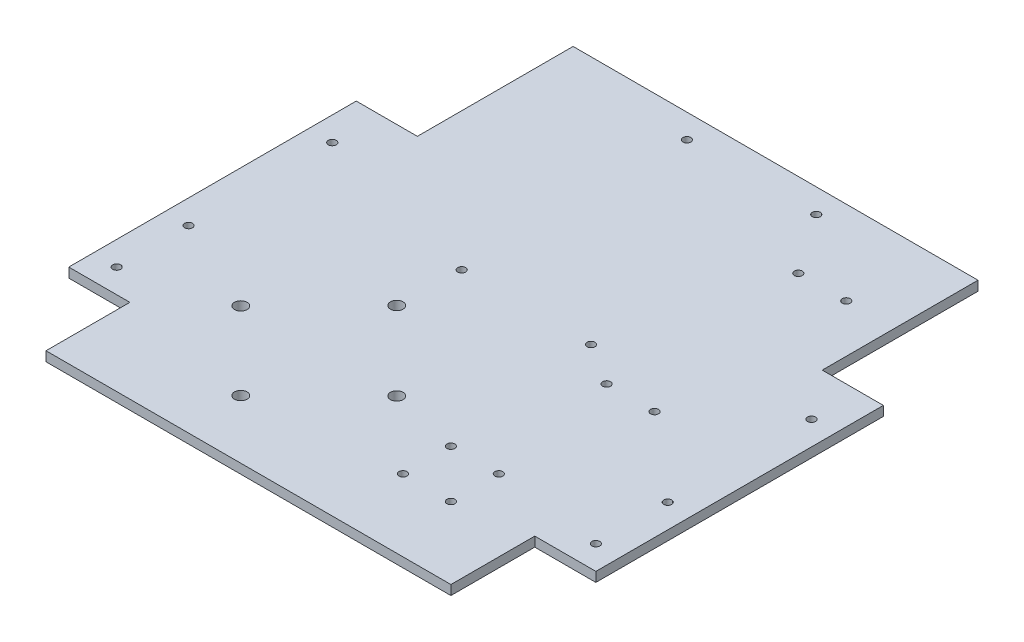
ISO-10303-21;
HEADER;
FILE_DESCRIPTION(('STEP AP214'),'2;1');
FILE_NAME('part.step','',(''),(''),'','','');
FILE_SCHEMA(('AUTOMOTIVE_DESIGN { 1 0 10303 214 1 1 1 1 }'));
ENDSEC;
DATA;
#1=APPLICATION_CONTEXT('core data for automotive mechanical design processes');
#2=APPLICATION_PROTOCOL_DEFINITION('international standard','automotive_design',2000,#1);
#3=PRODUCT_CONTEXT('',#1,'mechanical');
#4=PRODUCT('Part','Part','',(#3));
#5=PRODUCT_RELATED_PRODUCT_CATEGORY('part','',(#4));
#6=PRODUCT_DEFINITION_FORMATION('','',#4);
#7=PRODUCT_DEFINITION_CONTEXT('part definition',#1,'design');
#8=PRODUCT_DEFINITION('design','',#6,#7);
#9=PRODUCT_DEFINITION_SHAPE('','',#8);
#10=(LENGTH_UNIT() NAMED_UNIT(*) SI_UNIT(.MILLI.,.METRE.));
#11=(NAMED_UNIT(*) PLANE_ANGLE_UNIT() SI_UNIT($,.RADIAN.));
#12=(NAMED_UNIT(*) SI_UNIT($,.STERADIAN.) SOLID_ANGLE_UNIT());
#13=UNCERTAINTY_MEASURE_WITH_UNIT(LENGTH_MEASURE(1.E-05),#10,'distance_accuracy_value','');
#14=(GEOMETRIC_REPRESENTATION_CONTEXT(3) GLOBAL_UNCERTAINTY_ASSIGNED_CONTEXT((#13)) GLOBAL_UNIT_ASSIGNED_CONTEXT((#10,
#11,#12)) REPRESENTATION_CONTEXT('',''));
#15=CARTESIAN_POINT('',(0.,0.,0.));
#16=DIRECTION('',(0.,0.,1.));
#17=DIRECTION('',(1.,0.,0.));
#18=AXIS2_PLACEMENT_3D('',#15,#16,#17);
#19=CARTESIAN_POINT('',(84.5,-16.,0.));
#20=DIRECTION('',(-1.,0.,0.));
#21=DIRECTION('',(0.,1.,0.));
#22=AXIS2_PLACEMENT_3D('',#19,#20,#21);
#23=PLANE('',#22);
#24=DIRECTION('',(0.,0.,-1.));
#25=VECTOR('',#24,1.);
#26=CARTESIAN_POINT('',(84.5,0.,0.));
#27=LINE('',#26,#25);
#28=CARTESIAN_POINT('',(84.5,0.,-45.));
#29=VERTEX_POINT('',#28);
#30=CARTESIAN_POINT('',(84.5,0.,-110.));
#31=VERTEX_POINT('',#30);
#32=EDGE_CURVE('E170',#29,#31,#27,.T.);
#33=ORIENTED_EDGE('',*,*,#32,.T.);
#34=DIRECTION('',(0.,-1.,0.));
#35=VECTOR('',#34,1.);
#36=CARTESIAN_POINT('',(84.5,4.,-110.));
#37=LINE('',#36,#35);
#38=CARTESIAN_POINT('',(84.5,4.,-110.));
#39=VERTEX_POINT('',#38);
#40=EDGE_CURVE('E185',#39,#31,#37,.T.);
#41=ORIENTED_EDGE('',*,*,#40,.F.);
#42=DIRECTION('',(0.,0.,1.));
#43=VECTOR('',#42,1.);
#44=CARTESIAN_POINT('',(84.5,4.,0.));
#45=LINE('',#44,#43);
#46=CARTESIAN_POINT('',(84.5,4.,-45.));
#47=VERTEX_POINT('',#46);
#48=EDGE_CURVE('E235',#39,#47,#45,.T.);
#49=ORIENTED_EDGE('',*,*,#48,.T.);
#50=DIRECTION('',(0.,1.,0.));
#51=VECTOR('',#50,1.);
#52=CARTESIAN_POINT('',(84.5,-16.,-45.));
#53=LINE('',#52,#51);
#54=EDGE_CURVE('E11',#29,#47,#53,.T.);
#55=ORIENTED_EDGE('',*,*,#54,.F.);
#56=EDGE_LOOP('',(#33,#41,#49,#55));
#57=FACE_BOUND('',#56,.T.);
#58=ADVANCED_FACE('F17',(#57),#23,.F.);
#59=CARTESIAN_POINT('',(0.,-16.,-45.));
#60=DIRECTION('',(0.,0.,-1.));
#61=DIRECTION('',(0.,-1.,0.));
#62=AXIS2_PLACEMENT_3D('',#59,#60,#61);
#63=PLANE('',#62);
#64=ORIENTED_EDGE('',*,*,#54,.T.);
#65=DIRECTION('',(-1.,0.,0.));
#66=VECTOR('',#65,1.);
#67=CARTESIAN_POINT('',(0.,4.,-45.));
#68=LINE('',#67,#66);
#69=CARTESIAN_POINT('',(110.,4.,-45.));
#70=VERTEX_POINT('',#69);
#71=EDGE_CURVE('E363',#70,#47,#68,.T.);
#72=ORIENTED_EDGE('',*,*,#71,.F.);
#73=DIRECTION('',(0.,1.,0.));
#74=VECTOR('',#73,1.);
#75=CARTESIAN_POINT('',(110.,-16.,-45.));
#76=LINE('',#75,#74);
#77=CARTESIAN_POINT('',(110.,0.,-45.));
#78=VERTEX_POINT('',#77);
#79=EDGE_CURVE('E128',#78,#70,#76,.T.);
#80=ORIENTED_EDGE('',*,*,#79,.F.);
#81=DIRECTION('',(1.,0.,0.));
#82=VECTOR('',#81,1.);
#83=CARTESIAN_POINT('',(0.,0.,-45.));
#84=LINE('',#83,#82);
#85=EDGE_CURVE('E163',#29,#78,#84,.T.);
#86=ORIENTED_EDGE('',*,*,#85,.F.);
#87=EDGE_LOOP('',(#64,#72,#80,#86));
#88=FACE_BOUND('',#87,.T.);
#89=ADVANCED_FACE('F522',(#88),#63,.T.);
#90=CARTESIAN_POINT('',(0.,-16.,-45.));
#91=DIRECTION('',(0.,0.,1.));
#92=DIRECTION('',(1.,0.,0.));
#93=AXIS2_PLACEMENT_3D('',#90,#91,#92);
#94=PLANE('',#93);
#95=DIRECTION('',(-1.,0.,0.));
#96=VECTOR('',#95,1.);
#97=CARTESIAN_POINT('',(0.,0.,-45.));
#98=LINE('',#97,#96);
#99=CARTESIAN_POINT('',(-84.5,0.,-45.));
#100=VERTEX_POINT('',#99);
#101=CARTESIAN_POINT('',(-110.,0.,-45.));
#102=VERTEX_POINT('',#101);
#103=EDGE_CURVE('E323',#100,#102,#98,.T.);
#104=ORIENTED_EDGE('',*,*,#103,.T.);
#105=DIRECTION('',(0.,-1.,0.));
#106=VECTOR('',#105,1.);
#107=CARTESIAN_POINT('',(-110.,4.,-45.));
#108=LINE('',#107,#106);
#109=CARTESIAN_POINT('',(-110.,4.,-45.));
#110=VERTEX_POINT('',#109);
#111=EDGE_CURVE('E178',#110,#102,#108,.T.);
#112=ORIENTED_EDGE('',*,*,#111,.F.);
#113=DIRECTION('',(1.,0.,0.));
#114=VECTOR('',#113,1.);
#115=CARTESIAN_POINT('',(0.,4.,-45.));
#116=LINE('',#115,#114);
#117=CARTESIAN_POINT('',(-84.5,4.,-45.));
#118=VERTEX_POINT('',#117);
#119=EDGE_CURVE('E217',#110,#118,#116,.T.);
#120=ORIENTED_EDGE('',*,*,#119,.T.);
#121=DIRECTION('',(0.,1.,0.));
#122=VECTOR('',#121,1.);
#123=CARTESIAN_POINT('',(-84.5,-16.,-45.));
#124=LINE('',#123,#122);
#125=EDGE_CURVE('E26',#100,#118,#124,.T.);
#126=ORIENTED_EDGE('',*,*,#125,.F.);
#127=EDGE_LOOP('',(#104,#112,#120,#126));
#128=FACE_BOUND('',#127,.T.);
#129=ADVANCED_FACE('F218',(#128),#94,.F.);
#130=CARTESIAN_POINT('',(-84.5,-16.,0.));
#131=DIRECTION('',(-1.,0.,0.));
#132=DIRECTION('',(0.,0.,1.));
#133=AXIS2_PLACEMENT_3D('',#130,#131,#132);
#134=PLANE('',#133);
#135=ORIENTED_EDGE('',*,*,#125,.T.);
#136=DIRECTION('',(0.,0.,1.));
#137=VECTOR('',#136,1.);
#138=CARTESIAN_POINT('',(-84.5,4.,0.));
#139=LINE('',#138,#137);
#140=CARTESIAN_POINT('',(-84.5,4.,-110.));
#141=VERTEX_POINT('',#140);
#142=EDGE_CURVE('E209',#141,#118,#139,.T.);
#143=ORIENTED_EDGE('',*,*,#142,.F.);
#144=DIRECTION('',(0.,1.,0.));
#145=VECTOR('',#144,1.);
#146=CARTESIAN_POINT('',(-84.5,-16.,-110.));
#147=LINE('',#146,#145);
#148=CARTESIAN_POINT('',(-84.5,0.,-110.));
#149=VERTEX_POINT('',#148);
#150=EDGE_CURVE('E188',#149,#141,#147,.T.);
#151=ORIENTED_EDGE('',*,*,#150,.F.);
#152=DIRECTION('',(0.,0.,-1.));
#153=VECTOR('',#152,1.);
#154=CARTESIAN_POINT('',(-84.5,0.,0.));
#155=LINE('',#154,#153);
#156=EDGE_CURVE('E212',#100,#149,#155,.T.);
#157=ORIENTED_EDGE('',*,*,#156,.F.);
#158=EDGE_LOOP('',(#135,#143,#151,#157));
#159=FACE_BOUND('',#158,.T.);
#160=ADVANCED_FACE('F207',(#159),#134,.T.);
#161=CARTESIAN_POINT('',(-84.5,-16.,0.));
#162=DIRECTION('',(1.,0.,0.));
#163=DIRECTION('',(0.,0.,-1.));
#164=AXIS2_PLACEMENT_3D('',#161,#162,#163);
#165=PLANE('',#164);
#166=DIRECTION('',(0.,0.,1.));
#167=VECTOR('',#166,1.);
#168=CARTESIAN_POINT('',(-84.5,0.,0.));
#169=LINE('',#168,#167);
#170=CARTESIAN_POINT('',(-84.5,0.,75.));
#171=VERTEX_POINT('',#170);
#172=CARTESIAN_POINT('',(-84.5,0.,110.));
#173=VERTEX_POINT('',#172);
#174=EDGE_CURVE('E246',#171,#173,#169,.T.);
#175=ORIENTED_EDGE('',*,*,#174,.T.);
#176=DIRECTION('',(0.,-1.,0.));
#177=VECTOR('',#176,1.);
#178=CARTESIAN_POINT('',(-84.5,4.,110.));
#179=LINE('',#178,#177);
#180=CARTESIAN_POINT('',(-84.5,4.,110.));
#181=VERTEX_POINT('',#180);
#182=EDGE_CURVE('E180',#181,#173,#179,.T.);
#183=ORIENTED_EDGE('',*,*,#182,.F.);
#184=DIRECTION('',(0.,0.,-1.));
#185=VECTOR('',#184,1.);
#186=CARTESIAN_POINT('',(-84.5,4.,0.));
#187=LINE('',#186,#185);
#188=CARTESIAN_POINT('',(-84.5,4.,75.));
#189=VERTEX_POINT('',#188);
#190=EDGE_CURVE('E346',#181,#189,#187,.T.);
#191=ORIENTED_EDGE('',*,*,#190,.T.);
#192=DIRECTION('',(0.,1.,0.));
#193=VECTOR('',#192,1.);
#194=CARTESIAN_POINT('',(-84.5,-16.,75.));
#195=LINE('',#194,#193);
#196=EDGE_CURVE('E198',#171,#189,#195,.T.);
#197=ORIENTED_EDGE('',*,*,#196,.F.);
#198=EDGE_LOOP('',(#175,#183,#191,#197));
#199=FACE_BOUND('',#198,.T.);
#200=ADVANCED_FACE('F628',(#199),#165,.F.);
#201=CARTESIAN_POINT('',(0.,-16.,75.));
#202=DIRECTION('',(0.,0.,1.));
#203=DIRECTION('',(1.,0.,0.));
#204=AXIS2_PLACEMENT_3D('',#201,#202,#203);
#205=PLANE('',#204);
#206=ORIENTED_EDGE('',*,*,#196,.T.);
#207=DIRECTION('',(1.,0.,0.));
#208=VECTOR('',#207,1.);
#209=CARTESIAN_POINT('',(0.,4.,75.));
#210=LINE('',#209,#208);
#211=CARTESIAN_POINT('',(-110.,4.,75.));
#212=VERTEX_POINT('',#211);
#213=EDGE_CURVE('E251',#212,#189,#210,.T.);
#214=ORIENTED_EDGE('',*,*,#213,.F.);
#215=DIRECTION('',(0.,1.,0.));
#216=VECTOR('',#215,1.);
#217=CARTESIAN_POINT('',(-110.,-16.,75.));
#218=LINE('',#217,#216);
#219=CARTESIAN_POINT('',(-110.,0.,75.));
#220=VERTEX_POINT('',#219);
#221=EDGE_CURVE('E181',#220,#212,#218,.T.);
#222=ORIENTED_EDGE('',*,*,#221,.F.);
#223=DIRECTION('',(-1.,0.,0.));
#224=VECTOR('',#223,1.);
#225=CARTESIAN_POINT('',(0.,0.,75.));
#226=LINE('',#225,#224);
#227=EDGE_CURVE('E241',#171,#220,#226,.T.);
#228=ORIENTED_EDGE('',*,*,#227,.F.);
#229=EDGE_LOOP('',(#206,#214,#222,#228));
#230=FACE_BOUND('',#229,.T.);
#231=ADVANCED_FACE('F610',(#230),#205,.T.);
#232=CARTESIAN_POINT('',(0.,-16.,75.));
#233=DIRECTION('',(0.,0.,-1.));
#234=DIRECTION('',(0.,-1.,0.));
#235=AXIS2_PLACEMENT_3D('',#232,#233,#234);
#236=PLANE('',#235);
#237=DIRECTION('',(1.,0.,0.));
#238=VECTOR('',#237,1.);
#239=CARTESIAN_POINT('',(0.,0.,75.));
#240=LINE('',#239,#238);
#241=CARTESIAN_POINT('',(84.5,0.,75.));
#242=VERTEX_POINT('',#241);
#243=CARTESIAN_POINT('',(110.,0.,75.));
#244=VERTEX_POINT('',#243);
#245=EDGE_CURVE('E152',#242,#244,#240,.T.);
#246=ORIENTED_EDGE('',*,*,#245,.T.);
#247=DIRECTION('',(0.,1.,0.));
#248=VECTOR('',#247,1.);
#249=CARTESIAN_POINT('',(110.,-16.,75.));
#250=LINE('',#249,#248);
#251=CARTESIAN_POINT('',(110.,4.,75.));
#252=VERTEX_POINT('',#251);
#253=EDGE_CURVE('E137',#244,#252,#250,.T.);
#254=ORIENTED_EDGE('',*,*,#253,.T.);
#255=DIRECTION('',(-1.,0.,0.));
#256=VECTOR('',#255,1.);
#257=CARTESIAN_POINT('',(0.,4.,75.));
#258=LINE('',#257,#256);
#259=CARTESIAN_POINT('',(84.5,4.,75.));
#260=VERTEX_POINT('',#259);
#261=EDGE_CURVE('E338',#252,#260,#258,.T.);
#262=ORIENTED_EDGE('',*,*,#261,.T.);
#263=DIRECTION('',(0.,1.,0.));
#264=VECTOR('',#263,1.);
#265=CARTESIAN_POINT('',(84.5,-16.,75.));
#266=LINE('',#265,#264);
#267=EDGE_CURVE('E154',#242,#260,#266,.T.);
#268=ORIENTED_EDGE('',*,*,#267,.F.);
#269=EDGE_LOOP('',(#246,#254,#262,#268));
#270=FACE_BOUND('',#269,.T.);
#271=ADVANCED_FACE('F153',(#270),#236,.F.);
#272=CARTESIAN_POINT('',(84.5,-16.,0.));
#273=DIRECTION('',(1.,0.,0.));
#274=DIRECTION('',(0.,1.,0.));
#275=AXIS2_PLACEMENT_3D('',#272,#273,#274);
#276=PLANE('',#275);
#277=ORIENTED_EDGE('',*,*,#267,.T.);
#278=DIRECTION('',(0.,0.,-1.));
#279=VECTOR('',#278,1.);
#280=CARTESIAN_POINT('',(84.5,4.,0.));
#281=LINE('',#280,#279);
#282=CARTESIAN_POINT('',(84.5,4.,110.));
#283=VERTEX_POINT('',#282);
#284=EDGE_CURVE('E341',#283,#260,#281,.T.);
#285=ORIENTED_EDGE('',*,*,#284,.F.);
#286=DIRECTION('',(0.,-1.,0.));
#287=VECTOR('',#286,1.);
#288=CARTESIAN_POINT('',(84.5,4.,110.));
#289=LINE('',#288,#287);
#290=CARTESIAN_POINT('',(84.5,0.,110.));
#291=VERTEX_POINT('',#290);
#292=EDGE_CURVE('E39',#283,#291,#289,.T.);
#293=ORIENTED_EDGE('',*,*,#292,.T.);
#294=DIRECTION('',(0.,0.,1.));
#295=VECTOR('',#294,1.);
#296=CARTESIAN_POINT('',(84.5,0.,0.));
#297=LINE('',#296,#295);
#298=EDGE_CURVE('E158',#242,#291,#297,.T.);
#299=ORIENTED_EDGE('',*,*,#298,.F.);
#300=EDGE_LOOP('',(#277,#285,#293,#299));
#301=FACE_BOUND('',#300,.T.);
#302=ADVANCED_FACE('F410',(#301),#276,.T.);
#303=CARTESIAN_POINT('',(-110.,4.,110.));
#304=DIRECTION('',(0.,0.,-1.));
#305=DIRECTION('',(0.,-1.,0.));
#306=AXIS2_PLACEMENT_3D('',#303,#304,#305);
#307=PLANE('',#306);
#308=DIRECTION('',(1.,0.,0.));
#309=VECTOR('',#308,1.);
#310=CARTESIAN_POINT('',(-110.,4.,110.));
#311=LINE('',#310,#309);
#312=EDGE_CURVE('E350',#181,#283,#311,.T.);
#313=ORIENTED_EDGE('',*,*,#312,.F.);
#314=ORIENTED_EDGE('',*,*,#182,.T.);
#315=DIRECTION('',(1.,0.,0.));
#316=VECTOR('',#315,1.);
#317=CARTESIAN_POINT('',(-110.,0.,110.));
#318=LINE('',#317,#316);
#319=EDGE_CURVE('E149',#173,#291,#318,.T.);
#320=ORIENTED_EDGE('',*,*,#319,.T.);
#321=ORIENTED_EDGE('',*,*,#292,.F.);
#322=EDGE_LOOP('',(#313,#314,#320,#321));
#323=FACE_BOUND('',#322,.T.);
#324=ADVANCED_FACE('F594',(#323),#307,.F.);
#325=CARTESIAN_POINT('',(-110.,4.,110.));
#326=DIRECTION('',(1.,0.,0.));
#327=DIRECTION('',(0.,1.,0.));
#328=AXIS2_PLACEMENT_3D('',#325,#326,#327);
#329=PLANE('',#328);
#330=ORIENTED_EDGE('',*,*,#221,.T.);
#331=DIRECTION('',(0.,0.,1.));
#332=VECTOR('',#331,1.);
#333=CARTESIAN_POINT('',(-110.,4.,110.));
#334=LINE('',#333,#332);
#335=EDGE_CURVE('E223',#110,#212,#334,.T.);
#336=ORIENTED_EDGE('',*,*,#335,.F.);
#337=ORIENTED_EDGE('',*,*,#111,.T.);
#338=DIRECTION('',(0.,0.,1.));
#339=VECTOR('',#338,1.);
#340=CARTESIAN_POINT('',(-110.,0.,110.));
#341=LINE('',#340,#339);
#342=EDGE_CURVE('E245',#102,#220,#341,.T.);
#343=ORIENTED_EDGE('',*,*,#342,.T.);
#344=EDGE_LOOP('',(#330,#336,#337,#343));
#345=FACE_BOUND('',#344,.T.);
#346=ADVANCED_FACE('F589',(#345),#329,.F.);
#347=CARTESIAN_POINT('',(-110.,4.,-110.));
#348=DIRECTION('',(0.,0.,1.));
#349=DIRECTION('',(1.,0.,0.));
#350=AXIS2_PLACEMENT_3D('',#347,#348,#349);
#351=PLANE('',#350);
#352=DIRECTION('',(-1.,0.,0.));
#353=VECTOR('',#352,1.);
#354=CARTESIAN_POINT('',(-110.,4.,-110.));
#355=LINE('',#354,#353);
#356=EDGE_CURVE('E229',#39,#141,#355,.T.);
#357=ORIENTED_EDGE('',*,*,#356,.F.);
#358=ORIENTED_EDGE('',*,*,#40,.T.);
#359=DIRECTION('',(-1.,0.,0.));
#360=VECTOR('',#359,1.);
#361=CARTESIAN_POINT('',(-110.,0.,-110.));
#362=LINE('',#361,#360);
#363=EDGE_CURVE('E371',#31,#149,#362,.T.);
#364=ORIENTED_EDGE('',*,*,#363,.T.);
#365=ORIENTED_EDGE('',*,*,#150,.T.);
#366=EDGE_LOOP('',(#357,#358,#364,#365));
#367=FACE_BOUND('',#366,.T.);
#368=ADVANCED_FACE('F381',(#367),#351,.F.);
#369=CARTESIAN_POINT('',(110.,4.,110.));
#370=DIRECTION('',(-1.,0.,0.));
#371=DIRECTION('',(0.,0.,1.));
#372=AXIS2_PLACEMENT_3D('',#369,#370,#371);
#373=PLANE('',#372);
#374=DIRECTION('',(0.,0.,-1.));
#375=VECTOR('',#374,1.);
#376=CARTESIAN_POINT('',(110.,4.,110.));
#377=LINE('',#376,#375);
#378=EDGE_CURVE('E144',#252,#70,#377,.T.);
#379=ORIENTED_EDGE('',*,*,#378,.F.);
#380=ORIENTED_EDGE('',*,*,#253,.F.);
#381=DIRECTION('',(0.,0.,-1.));
#382=VECTOR('',#381,1.);
#383=CARTESIAN_POINT('',(110.,0.,110.));
#384=LINE('',#383,#382);
#385=EDGE_CURVE('E141',#244,#78,#384,.T.);
#386=ORIENTED_EDGE('',*,*,#385,.T.);
#387=ORIENTED_EDGE('',*,*,#79,.T.);
#388=EDGE_LOOP('',(#379,#380,#386,#387));
#389=FACE_BOUND('',#388,.T.);
#390=ADVANCED_FACE('F139',(#389),#373,.F.);
#391=CARTESIAN_POINT('',(0.,0.,0.));
#392=DIRECTION('',(0.,-1.,0.));
#393=DIRECTION('',(0.,0.,-1.));
#394=AXIS2_PLACEMENT_3D('',#391,#392,#393);
#395=PLANE('',#394);
#396=CARTESIAN_POINT('',(-100.,0.,35.));
#397=DIRECTION('',(0.,1.,0.));
#398=DIRECTION('',(0.,0.,1.));
#399=AXIS2_PLACEMENT_3D('',#396,#397,#398);
#400=CIRCLE('',#399,1.65);
#401=CARTESIAN_POINT('',(-100.,0.,36.65));
#402=VERTEX_POINT('',#401);
#403=EDGE_CURVE('E327',#402,#402,#400,.T.);
#404=ORIENTED_EDGE('',*,*,#403,.T.);
#405=EDGE_LOOP('',(#404));
#406=FACE_BOUND('',#405,.T.);
#407=CARTESIAN_POINT('',(100.,0.,-25.));
#408=DIRECTION('',(0.,1.,0.));
#409=DIRECTION('',(0.,0.,1.));
#410=AXIS2_PLACEMENT_3D('',#407,#408,#409);
#411=CIRCLE('',#410,1.65);
#412=CARTESIAN_POINT('',(100.,0.,-23.35));
#413=VERTEX_POINT('',#412);
#414=EDGE_CURVE('E331',#413,#413,#411,.T.);
#415=ORIENTED_EDGE('',*,*,#414,.T.);
#416=EDGE_LOOP('',(#415));
#417=FACE_BOUND('',#416,.T.);
#418=CARTESIAN_POINT('',(-100.,0.,65.));
#419=DIRECTION('',(0.,1.,0.));
#420=DIRECTION('',(0.,0.,1.));
#421=AXIS2_PLACEMENT_3D('',#418,#419,#420);
#422=CIRCLE('',#421,1.65);
#423=CARTESIAN_POINT('',(-100.,0.,66.65));
#424=VERTEX_POINT('',#423);
#425=EDGE_CURVE('E305',#424,#424,#422,.T.);
#426=ORIENTED_EDGE('',*,*,#425,.T.);
#427=EDGE_LOOP('',(#426));
#428=FACE_BOUND('',#427,.T.);
#429=CARTESIAN_POINT('',(-100.,0.,-25.));
#430=DIRECTION('',(0.,1.,0.));
#431=DIRECTION('',(0.,0.,1.));
#432=AXIS2_PLACEMENT_3D('',#429,#430,#431);
#433=CIRCLE('',#432,1.65);
#434=CARTESIAN_POINT('',(-100.,0.,-23.35));
#435=VERTEX_POINT('',#434);
#436=EDGE_CURVE('E247',#435,#435,#433,.T.);
#437=ORIENTED_EDGE('',*,*,#436,.T.);
#438=EDGE_LOOP('',(#437));
#439=FACE_BOUND('',#438,.T.);
#440=CARTESIAN_POINT('',(100.,0.,65.));
#441=DIRECTION('',(0.,1.,0.));
#442=DIRECTION('',(0.,0.,1.));
#443=AXIS2_PLACEMENT_3D('',#440,#441,#442);
#444=CIRCLE('',#443,1.65);
#445=CARTESIAN_POINT('',(100.,0.,66.65));
#446=VERTEX_POINT('',#445);
#447=EDGE_CURVE('E344',#446,#446,#444,.T.);
#448=ORIENTED_EDGE('',*,*,#447,.T.);
#449=EDGE_LOOP('',(#448));
#450=FACE_BOUND('',#449,.T.);
#451=CARTESIAN_POINT('',(100.,0.,35.));
#452=DIRECTION('',(0.,1.,0.));
#453=DIRECTION('',(0.,0.,1.));
#454=AXIS2_PLACEMENT_3D('',#451,#452,#453);
#455=CIRCLE('',#454,1.65);
#456=CARTESIAN_POINT('',(100.,0.,36.65));
#457=VERTEX_POINT('',#456);
#458=EDGE_CURVE('E292',#457,#457,#455,.T.);
#459=ORIENTED_EDGE('',*,*,#458,.T.);
#460=EDGE_LOOP('',(#459));
#461=FACE_BOUND('',#460,.T.);
#462=CARTESIAN_POINT('',(-27.65,0.,20.45));
#463=DIRECTION('',(0.,-1.,0.));
#464=DIRECTION('',(0.,0.,-1.));
#465=AXIS2_PLACEMENT_3D('',#462,#463,#464);
#466=CIRCLE('',#465,2.65);
#467=CARTESIAN_POINT('',(-27.65,0.,17.8));
#468=VERTEX_POINT('',#467);
#469=EDGE_CURVE('E258',#468,#468,#466,.T.);
#470=ORIENTED_EDGE('',*,*,#469,.F.);
#471=EDGE_LOOP('',(#470));
#472=FACE_BOUND('',#471,.T.);
#473=CARTESIAN_POINT('',(-60.05,0.,53.15));
#474=DIRECTION('',(0.,-1.,0.));
#475=DIRECTION('',(0.,0.,-1.));
#476=AXIS2_PLACEMENT_3D('',#473,#474,#475);
#477=CIRCLE('',#476,2.65);
#478=CARTESIAN_POINT('',(-60.05,0.,50.5));
#479=VERTEX_POINT('',#478);
#480=EDGE_CURVE('E309',#479,#479,#477,.T.);
#481=ORIENTED_EDGE('',*,*,#480,.F.);
#482=EDGE_LOOP('',(#481));
#483=FACE_BOUND('',#482,.T.);
#484=CARTESIAN_POINT('',(5.05,0.,53.15));
#485=DIRECTION('',(0.,-1.,0.));
#486=DIRECTION('',(0.,0.,-1.));
#487=AXIS2_PLACEMENT_3D('',#484,#485,#486);
#488=CIRCLE('',#487,2.65);
#489=CARTESIAN_POINT('',(5.05,0.,50.5));
#490=VERTEX_POINT('',#489);
#491=EDGE_CURVE('E291',#490,#490,#488,.T.);
#492=ORIENTED_EDGE('',*,*,#491,.F.);
#493=EDGE_LOOP('',(#492));
#494=FACE_BOUND('',#493,.T.);
#495=CARTESIAN_POINT('',(-27.65,0.,85.55));
#496=DIRECTION('',(0.,-1.,0.));
#497=DIRECTION('',(0.,0.,-1.));
#498=AXIS2_PLACEMENT_3D('',#495,#496,#497);
#499=CIRCLE('',#498,2.65);
#500=CARTESIAN_POINT('',(-27.65,0.,82.9));
#501=VERTEX_POINT('',#500);
#502=EDGE_CURVE('E282',#501,#501,#499,.T.);
#503=ORIENTED_EDGE('',*,*,#502,.F.);
#504=EDGE_LOOP('',(#503));
#505=FACE_BOUND('',#504,.T.);
#506=CARTESIAN_POINT('',(27.,0.,-6.));
#507=DIRECTION('',(0.,-1.,0.));
#508=DIRECTION('',(0.,0.,-1.));
#509=AXIS2_PLACEMENT_3D('',#506,#507,#508);
#510=CIRCLE('',#509,1.65000000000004);
#511=CARTESIAN_POINT('',(27.,0.,-7.65000000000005));
#512=VERTEX_POINT('',#511);
#513=EDGE_CURVE('E280',#512,#512,#510,.T.);
#514=ORIENTED_EDGE('',*,*,#513,.F.);
#515=EDGE_LOOP('',(#514));
#516=FACE_BOUND('',#515,.T.);
#517=CARTESIAN_POINT('',(-27.,0.,-6.));
#518=DIRECTION('',(0.,-1.,0.));
#519=DIRECTION('',(0.,0.,-1.));
#520=AXIS2_PLACEMENT_3D('',#517,#518,#519);
#521=CIRCLE('',#520,1.65000000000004);
#522=CARTESIAN_POINT('',(-27.,0.,-7.65000000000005));
#523=VERTEX_POINT('',#522);
#524=EDGE_CURVE('E276',#523,#523,#521,.T.);
#525=ORIENTED_EDGE('',*,*,#524,.F.);
#526=EDGE_LOOP('',(#525));
#527=FACE_BOUND('',#526,.T.);
#528=CARTESIAN_POINT('',(-27.,0.,-100.));
#529=DIRECTION('',(0.,-1.,0.));
#530=DIRECTION('',(0.,0.,-1.));
#531=AXIS2_PLACEMENT_3D('',#528,#529,#530);
#532=CIRCLE('',#531,1.65000000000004);
#533=CARTESIAN_POINT('',(-27.,0.,-101.65));
#534=VERTEX_POINT('',#533);
#535=EDGE_CURVE('E268',#534,#534,#532,.T.);
#536=ORIENTED_EDGE('',*,*,#535,.F.);
#537=EDGE_LOOP('',(#536));
#538=FACE_BOUND('',#537,.T.);
#539=CARTESIAN_POINT('',(27.,0.,-100.));
#540=DIRECTION('',(0.,-1.,0.));
#541=DIRECTION('',(0.,0.,-1.));
#542=AXIS2_PLACEMENT_3D('',#539,#540,#541);
#543=CIRCLE('',#542,1.65000000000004);
#544=CARTESIAN_POINT('',(27.,0.,-101.65));
#545=VERTEX_POINT('',#544);
#546=EDGE_CURVE('E259',#545,#545,#543,.T.);
#547=ORIENTED_EDGE('',*,*,#546,.F.);
#548=EDGE_LOOP('',(#547));
#549=FACE_BOUND('',#548,.T.);
#550=CARTESIAN_POINT('',(34.5,0.,60.));
#551=DIRECTION('',(0.,-1.,0.));
#552=DIRECTION('',(0.,0.,-1.));
#553=AXIS2_PLACEMENT_3D('',#550,#551,#552);
#554=CIRCLE('',#553,1.65);
#555=CARTESIAN_POINT('',(34.5,0.,58.35));
#556=VERTEX_POINT('',#555);
#557=EDGE_CURVE('E239',#556,#556,#554,.T.);
#558=ORIENTED_EDGE('',*,*,#557,.F.);
#559=EDGE_LOOP('',(#558));
#560=FACE_BOUND('',#559,.T.);
#561=CARTESIAN_POINT('',(44.5,0.,5.));
#562=DIRECTION('',(0.,-1.,0.));
#563=DIRECTION('',(0.,0.,-1.));
#564=AXIS2_PLACEMENT_3D('',#561,#562,#563);
#565=CIRCLE('',#564,1.65);
#566=CARTESIAN_POINT('',(44.5,0.,3.35));
#567=VERTEX_POINT('',#566);
#568=EDGE_CURVE('E396',#567,#567,#565,.T.);
#569=ORIENTED_EDGE('',*,*,#568,.F.);
#570=EDGE_LOOP('',(#569));
#571=FACE_BOUND('',#570,.T.);
#572=CARTESIAN_POINT('',(64.5,0.,5.));
#573=DIRECTION('',(0.,-1.,0.));
#574=DIRECTION('',(0.,0.,-1.));
#575=AXIS2_PLACEMENT_3D('',#572,#573,#574);
#576=CIRCLE('',#575,1.65);
#577=CARTESIAN_POINT('',(64.5,0.,3.35));
#578=VERTEX_POINT('',#577);
#579=EDGE_CURVE('E391',#578,#578,#576,.T.);
#580=ORIENTED_EDGE('',*,*,#579,.F.);
#581=EDGE_LOOP('',(#580));
#582=FACE_BOUND('',#581,.T.);
#583=CARTESIAN_POINT('',(64.5,0.,-75.));
#584=DIRECTION('',(0.,-1.,0.));
#585=DIRECTION('',(0.,0.,-1.));
#586=AXIS2_PLACEMENT_3D('',#583,#584,#585);
#587=CIRCLE('',#586,1.65);
#588=CARTESIAN_POINT('',(64.5,0.,-76.65));
#589=VERTEX_POINT('',#588);
#590=EDGE_CURVE('E420',#589,#589,#587,.T.);
#591=ORIENTED_EDGE('',*,*,#590,.F.);
#592=EDGE_LOOP('',(#591));
#593=FACE_BOUND('',#592,.T.);
#594=CARTESIAN_POINT('',(44.5,0.,-75.));
#595=DIRECTION('',(0.,-1.,0.));
#596=DIRECTION('',(0.,0.,-1.));
#597=AXIS2_PLACEMENT_3D('',#594,#595,#596);
#598=CIRCLE('',#597,1.65);
#599=CARTESIAN_POINT('',(44.5,0.,-76.65));
#600=VERTEX_POINT('',#599);
#601=EDGE_CURVE('E454',#600,#600,#598,.T.);
#602=ORIENTED_EDGE('',*,*,#601,.F.);
#603=EDGE_LOOP('',(#602));
#604=FACE_BOUND('',#603,.T.);
#605=CARTESIAN_POINT('',(34.5,0.,80.));
#606=DIRECTION('',(0.,-1.,0.));
#607=DIRECTION('',(0.,0.,-1.));
#608=AXIS2_PLACEMENT_3D('',#605,#606,#607);
#609=CIRCLE('',#608,1.65);
#610=CARTESIAN_POINT('',(34.5,0.,78.35));
#611=VERTEX_POINT('',#610);
#612=EDGE_CURVE('E470',#611,#611,#609,.T.);
#613=ORIENTED_EDGE('',*,*,#612,.F.);
#614=EDGE_LOOP('',(#613));
#615=FACE_BOUND('',#614,.T.);
#616=CARTESIAN_POINT('',(54.5,0.,80.));
#617=DIRECTION('',(0.,-1.,0.));
#618=DIRECTION('',(0.,0.,-1.));
#619=AXIS2_PLACEMENT_3D('',#616,#617,#618);
#620=CIRCLE('',#619,1.65);
#621=CARTESIAN_POINT('',(54.5,0.,78.35));
#622=VERTEX_POINT('',#621);
#623=EDGE_CURVE('E453',#622,#622,#620,.T.);
#624=ORIENTED_EDGE('',*,*,#623,.F.);
#625=EDGE_LOOP('',(#624));
#626=FACE_BOUND('',#625,.T.);
#627=CARTESIAN_POINT('',(54.5,0.,60.));
#628=DIRECTION('',(0.,-1.,0.));
#629=DIRECTION('',(0.,0.,-1.));
#630=AXIS2_PLACEMENT_3D('',#627,#628,#629);
#631=CIRCLE('',#630,1.65);
#632=CARTESIAN_POINT('',(54.5,0.,58.35));
#633=VERTEX_POINT('',#632);
#634=EDGE_CURVE('E445',#633,#633,#631,.T.);
#635=ORIENTED_EDGE('',*,*,#634,.F.);
#636=EDGE_LOOP('',(#635));
#637=FACE_BOUND('',#636,.T.);
#638=ORIENTED_EDGE('',*,*,#174,.F.);
#639=ORIENTED_EDGE('',*,*,#227,.T.);
#640=ORIENTED_EDGE('',*,*,#342,.F.);
#641=ORIENTED_EDGE('',*,*,#103,.F.);
#642=ORIENTED_EDGE('',*,*,#156,.T.);
#643=ORIENTED_EDGE('',*,*,#363,.F.);
#644=ORIENTED_EDGE('',*,*,#32,.F.);
#645=ORIENTED_EDGE('',*,*,#85,.T.);
#646=ORIENTED_EDGE('',*,*,#385,.F.);
#647=ORIENTED_EDGE('',*,*,#245,.F.);
#648=ORIENTED_EDGE('',*,*,#298,.T.);
#649=ORIENTED_EDGE('',*,*,#319,.F.);
#650=EDGE_LOOP('',(#638,#639,#640,#641,#642,#643,#644,#645,#646,#647,#648,#649));
#651=FACE_BOUND('',#650,.T.);
#652=ADVANCED_FACE('F161',(#406,#417,#428,#439,#450,#461,#472,#483,#494,#505,#516,#527,#538,
#549,#560,#571,#582,#593,#604,#615,#626,#637,#651),#395,.T.);
#653=CARTESIAN_POINT('',(0.,4.,0.));
#654=DIRECTION('',(0.,-1.,0.));
#655=DIRECTION('',(0.,0.,-1.));
#656=AXIS2_PLACEMENT_3D('',#653,#654,#655);
#657=PLANE('',#656);
#658=CARTESIAN_POINT('',(-100.,4.,35.));
#659=DIRECTION('',(0.,1.,0.));
#660=DIRECTION('',(0.,0.,1.));
#661=AXIS2_PLACEMENT_3D('',#658,#659,#660);
#662=CIRCLE('',#661,1.65);
#663=CARTESIAN_POINT('',(-100.,4.,36.65));
#664=VERTEX_POINT('',#663);
#665=EDGE_CURVE('E257',#664,#664,#662,.T.);
#666=ORIENTED_EDGE('',*,*,#665,.F.);
#667=EDGE_LOOP('',(#666));
#668=FACE_BOUND('',#667,.T.);
#669=CARTESIAN_POINT('',(100.,4.,35.));
#670=DIRECTION('',(0.,1.,0.));
#671=DIRECTION('',(0.,0.,1.));
#672=AXIS2_PLACEMENT_3D('',#669,#670,#671);
#673=CIRCLE('',#672,1.65);
#674=CARTESIAN_POINT('',(100.,4.,36.65));
#675=VERTEX_POINT('',#674);
#676=EDGE_CURVE('E297',#675,#675,#673,.T.);
#677=ORIENTED_EDGE('',*,*,#676,.F.);
#678=EDGE_LOOP('',(#677));
#679=FACE_BOUND('',#678,.T.);
#680=CARTESIAN_POINT('',(100.,4.,-25.));
#681=DIRECTION('',(0.,1.,0.));
#682=DIRECTION('',(0.,0.,1.));
#683=AXIS2_PLACEMENT_3D('',#680,#681,#682);
#684=CIRCLE('',#683,1.65);
#685=CARTESIAN_POINT('',(100.,4.,-23.35));
#686=VERTEX_POINT('',#685);
#687=EDGE_CURVE('E296',#686,#686,#684,.T.);
#688=ORIENTED_EDGE('',*,*,#687,.F.);
#689=EDGE_LOOP('',(#688));
#690=FACE_BOUND('',#689,.T.);
#691=CARTESIAN_POINT('',(100.,4.,65.));
#692=DIRECTION('',(0.,1.,0.));
#693=DIRECTION('',(0.,0.,1.));
#694=AXIS2_PLACEMENT_3D('',#691,#692,#693);
#695=CIRCLE('',#694,1.65);
#696=CARTESIAN_POINT('',(100.,4.,66.65));
#697=VERTEX_POINT('',#696);
#698=EDGE_CURVE('E335',#697,#697,#695,.T.);
#699=ORIENTED_EDGE('',*,*,#698,.F.);
#700=EDGE_LOOP('',(#699));
#701=FACE_BOUND('',#700,.T.);
#702=CARTESIAN_POINT('',(-100.,4.,65.));
#703=DIRECTION('',(0.,1.,0.));
#704=DIRECTION('',(0.,0.,1.));
#705=AXIS2_PLACEMENT_3D('',#702,#703,#704);
#706=CIRCLE('',#705,1.65);
#707=CARTESIAN_POINT('',(-100.,4.,66.65));
#708=VERTEX_POINT('',#707);
#709=EDGE_CURVE('E354',#708,#708,#706,.T.);
#710=ORIENTED_EDGE('',*,*,#709,.F.);
#711=EDGE_LOOP('',(#710));
#712=FACE_BOUND('',#711,.T.);
#713=CARTESIAN_POINT('',(-100.,4.,-25.));
#714=DIRECTION('',(0.,1.,0.));
#715=DIRECTION('',(0.,0.,1.));
#716=AXIS2_PLACEMENT_3D('',#713,#714,#715);
#717=CIRCLE('',#716,1.65);
#718=CARTESIAN_POINT('',(-100.,4.,-23.35));
#719=VERTEX_POINT('',#718);
#720=EDGE_CURVE('E252',#719,#719,#717,.T.);
#721=ORIENTED_EDGE('',*,*,#720,.F.);
#722=EDGE_LOOP('',(#721));
#723=FACE_BOUND('',#722,.T.);
#724=CARTESIAN_POINT('',(-27.65,4.,20.45));
#725=DIRECTION('',(0.,1.,0.));
#726=DIRECTION('',(0.,0.,1.));
#727=AXIS2_PLACEMENT_3D('',#724,#725,#726);
#728=CIRCLE('',#727,2.65);
#729=CARTESIAN_POINT('',(-27.65,4.,23.1));
#730=VERTEX_POINT('',#729);
#731=EDGE_CURVE('E253',#730,#730,#728,.T.);
#732=ORIENTED_EDGE('',*,*,#731,.F.);
#733=EDGE_LOOP('',(#732));
#734=FACE_BOUND('',#733,.T.);
#735=CARTESIAN_POINT('',(-60.05,4.,53.15));
#736=DIRECTION('',(0.,1.,0.));
#737=DIRECTION('',(0.,0.,1.));
#738=AXIS2_PLACEMENT_3D('',#735,#736,#737);
#739=CIRCLE('',#738,2.65);
#740=CARTESIAN_POINT('',(-60.05,4.,55.8));
#741=VERTEX_POINT('',#740);
#742=EDGE_CURVE('E313',#741,#741,#739,.T.);
#743=ORIENTED_EDGE('',*,*,#742,.F.);
#744=EDGE_LOOP('',(#743));
#745=FACE_BOUND('',#744,.T.);
#746=CARTESIAN_POINT('',(5.05,4.,53.15));
#747=DIRECTION('',(0.,1.,0.));
#748=DIRECTION('',(0.,0.,1.));
#749=AXIS2_PLACEMENT_3D('',#746,#747,#748);
#750=CIRCLE('',#749,2.65);
#751=CARTESIAN_POINT('',(5.05,4.,55.8));
#752=VERTEX_POINT('',#751);
#753=EDGE_CURVE('E301',#752,#752,#750,.T.);
#754=ORIENTED_EDGE('',*,*,#753,.F.);
#755=EDGE_LOOP('',(#754));
#756=FACE_BOUND('',#755,.T.);
#757=CARTESIAN_POINT('',(-27.65,4.,85.55));
#758=DIRECTION('',(0.,1.,0.));
#759=DIRECTION('',(0.,0.,1.));
#760=AXIS2_PLACEMENT_3D('',#757,#758,#759);
#761=CIRCLE('',#760,2.65);
#762=CARTESIAN_POINT('',(-27.65,4.,88.2));
#763=VERTEX_POINT('',#762);
#764=EDGE_CURVE('E286',#763,#763,#761,.T.);
#765=ORIENTED_EDGE('',*,*,#764,.F.);
#766=EDGE_LOOP('',(#765));
#767=FACE_BOUND('',#766,.T.);
#768=CARTESIAN_POINT('',(27.,4.,-6.));
#769=DIRECTION('',(0.,1.,0.));
#770=DIRECTION('',(0.,0.,1.));
#771=AXIS2_PLACEMENT_3D('',#768,#769,#770);
#772=CIRCLE('',#771,1.65000000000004);
#773=CARTESIAN_POINT('',(27.,4.,-4.34999999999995));
#774=VERTEX_POINT('',#773);
#775=EDGE_CURVE('E287',#774,#774,#772,.T.);
#776=ORIENTED_EDGE('',*,*,#775,.F.);
#777=EDGE_LOOP('',(#776));
#778=FACE_BOUND('',#777,.T.);
#779=CARTESIAN_POINT('',(-27.,4.,-6.));
#780=DIRECTION('',(0.,1.,0.));
#781=DIRECTION('',(0.,0.,1.));
#782=AXIS2_PLACEMENT_3D('',#779,#780,#781);
#783=CIRCLE('',#782,1.65000000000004);
#784=CARTESIAN_POINT('',(-27.,4.,-4.34999999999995));
#785=VERTEX_POINT('',#784);
#786=EDGE_CURVE('E277',#785,#785,#783,.T.);
#787=ORIENTED_EDGE('',*,*,#786,.F.);
#788=EDGE_LOOP('',(#787));
#789=FACE_BOUND('',#788,.T.);
#790=CARTESIAN_POINT('',(-27.,4.,-100.));
#791=DIRECTION('',(0.,1.,0.));
#792=DIRECTION('',(0.,0.,1.));
#793=AXIS2_PLACEMENT_3D('',#790,#791,#792);
#794=CIRCLE('',#793,1.65000000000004);
#795=CARTESIAN_POINT('',(-27.,4.,-98.35));
#796=VERTEX_POINT('',#795);
#797=EDGE_CURVE('E272',#796,#796,#794,.T.);
#798=ORIENTED_EDGE('',*,*,#797,.F.);
#799=EDGE_LOOP('',(#798));
#800=FACE_BOUND('',#799,.T.);
#801=CARTESIAN_POINT('',(27.,4.,-100.));
#802=DIRECTION('',(0.,1.,0.));
#803=DIRECTION('',(0.,0.,1.));
#804=AXIS2_PLACEMENT_3D('',#801,#802,#803);
#805=CIRCLE('',#804,1.65000000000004);
#806=CARTESIAN_POINT('',(27.,4.,-98.35));
#807=VERTEX_POINT('',#806);
#808=EDGE_CURVE('E263',#807,#807,#805,.T.);
#809=ORIENTED_EDGE('',*,*,#808,.F.);
#810=EDGE_LOOP('',(#809));
#811=FACE_BOUND('',#810,.T.);
#812=CARTESIAN_POINT('',(34.5,4.,60.));
#813=DIRECTION('',(0.,1.,0.));
#814=DIRECTION('',(0.,0.,1.));
#815=AXIS2_PLACEMENT_3D('',#812,#813,#814);
#816=CIRCLE('',#815,1.65);
#817=CARTESIAN_POINT('',(34.5,4.,61.65));
#818=VERTEX_POINT('',#817);
#819=EDGE_CURVE('E264',#818,#818,#816,.T.);
#820=ORIENTED_EDGE('',*,*,#819,.F.);
#821=EDGE_LOOP('',(#820));
#822=FACE_BOUND('',#821,.T.);
#823=CARTESIAN_POINT('',(44.5,4.,5.));
#824=DIRECTION('',(0.,1.,0.));
#825=DIRECTION('',(0.,0.,1.));
#826=AXIS2_PLACEMENT_3D('',#823,#824,#825);
#827=CIRCLE('',#826,1.65);
#828=CARTESIAN_POINT('',(44.5,4.,6.65));
#829=VERTEX_POINT('',#828);
#830=EDGE_CURVE('E406',#829,#829,#827,.T.);
#831=ORIENTED_EDGE('',*,*,#830,.F.);
#832=EDGE_LOOP('',(#831));
#833=FACE_BOUND('',#832,.T.);
#834=CARTESIAN_POINT('',(64.5,4.,5.));
#835=DIRECTION('',(0.,1.,0.));
#836=DIRECTION('',(0.,0.,1.));
#837=AXIS2_PLACEMENT_3D('',#834,#835,#836);
#838=CIRCLE('',#837,1.65);
#839=CARTESIAN_POINT('',(64.5,4.,6.65));
#840=VERTEX_POINT('',#839);
#841=EDGE_CURVE('E393',#840,#840,#838,.T.);
#842=ORIENTED_EDGE('',*,*,#841,.F.);
#843=EDGE_LOOP('',(#842));
#844=FACE_BOUND('',#843,.T.);
#845=CARTESIAN_POINT('',(64.5,4.,-75.));
#846=DIRECTION('',(0.,1.,0.));
#847=DIRECTION('',(0.,0.,1.));
#848=AXIS2_PLACEMENT_3D('',#845,#846,#847);
#849=CIRCLE('',#848,1.65);
#850=CARTESIAN_POINT('',(64.5,4.,-73.35));
#851=VERTEX_POINT('',#850);
#852=EDGE_CURVE('E422',#851,#851,#849,.T.);
#853=ORIENTED_EDGE('',*,*,#852,.F.);
#854=EDGE_LOOP('',(#853));
#855=FACE_BOUND('',#854,.T.);
#856=CARTESIAN_POINT('',(44.5,4.,-75.));
#857=DIRECTION('',(0.,1.,0.));
#858=DIRECTION('',(0.,0.,1.));
#859=AXIS2_PLACEMENT_3D('',#856,#857,#858);
#860=CIRCLE('',#859,1.65);
#861=CARTESIAN_POINT('',(44.5,4.,-73.35));
#862=VERTEX_POINT('',#861);
#863=EDGE_CURVE('E458',#862,#862,#860,.T.);
#864=ORIENTED_EDGE('',*,*,#863,.F.);
#865=EDGE_LOOP('',(#864));
#866=FACE_BOUND('',#865,.T.);
#867=CARTESIAN_POINT('',(34.5,4.,80.));
#868=DIRECTION('',(0.,1.,0.));
#869=DIRECTION('',(0.,0.,1.));
#870=AXIS2_PLACEMENT_3D('',#867,#868,#869);
#871=CIRCLE('',#870,1.65);
#872=CARTESIAN_POINT('',(34.5,4.,81.65));
#873=VERTEX_POINT('',#872);
#874=EDGE_CURVE('E459',#873,#873,#871,.T.);
#875=ORIENTED_EDGE('',*,*,#874,.F.);
#876=EDGE_LOOP('',(#875));
#877=FACE_BOUND('',#876,.T.);
#878=CARTESIAN_POINT('',(54.5,4.,80.));
#879=DIRECTION('',(0.,1.,0.));
#880=DIRECTION('',(0.,0.,1.));
#881=AXIS2_PLACEMENT_3D('',#878,#879,#880);
#882=CIRCLE('',#881,1.65);
#883=CARTESIAN_POINT('',(54.5,4.,81.65));
#884=VERTEX_POINT('',#883);
#885=EDGE_CURVE('E466',#884,#884,#882,.T.);
#886=ORIENTED_EDGE('',*,*,#885,.F.);
#887=EDGE_LOOP('',(#886));
#888=FACE_BOUND('',#887,.T.);
#889=CARTESIAN_POINT('',(54.5,4.,60.));
#890=DIRECTION('',(0.,1.,0.));
#891=DIRECTION('',(0.,0.,1.));
#892=AXIS2_PLACEMENT_3D('',#889,#890,#891);
#893=CIRCLE('',#892,1.65);
#894=CARTESIAN_POINT('',(54.5,4.,61.65));
#895=VERTEX_POINT('',#894);
#896=EDGE_CURVE('E449',#895,#895,#893,.T.);
#897=ORIENTED_EDGE('',*,*,#896,.F.);
#898=EDGE_LOOP('',(#897));
#899=FACE_BOUND('',#898,.T.);
#900=ORIENTED_EDGE('',*,*,#213,.T.);
#901=ORIENTED_EDGE('',*,*,#190,.F.);
#902=ORIENTED_EDGE('',*,*,#312,.T.);
#903=ORIENTED_EDGE('',*,*,#284,.T.);
#904=ORIENTED_EDGE('',*,*,#261,.F.);
#905=ORIENTED_EDGE('',*,*,#378,.T.);
#906=ORIENTED_EDGE('',*,*,#71,.T.);
#907=ORIENTED_EDGE('',*,*,#48,.F.);
#908=ORIENTED_EDGE('',*,*,#356,.T.);
#909=ORIENTED_EDGE('',*,*,#142,.T.);
#910=ORIENTED_EDGE('',*,*,#119,.F.);
#911=ORIENTED_EDGE('',*,*,#335,.T.);
#912=EDGE_LOOP('',(#900,#901,#902,#903,#904,#905,#906,#907,#908,#909,#910,#911));
#913=FACE_BOUND('',#912,.T.);
#914=ADVANCED_FACE('F226',(#668,#679,#690,#701,#712,#723,#734,#745,#756,#767,#778,#789,#800,
#811,#822,#833,#844,#855,#866,#877,#888,#899,#913),#657,.F.);
#915=CARTESIAN_POINT('',(-100.,4.,-25.));
#916=DIRECTION('',(0.,-1.,0.));
#917=DIRECTION('',(0.,0.,-1.));
#918=AXIS2_PLACEMENT_3D('',#915,#916,#917);
#919=CYLINDRICAL_SURFACE('',#918,1.65);
#920=ORIENTED_EDGE('',*,*,#436,.F.);
#921=EDGE_LOOP('',(#920));
#922=FACE_BOUND('',#921,.T.);
#923=ORIENTED_EDGE('',*,*,#720,.T.);
#924=EDGE_LOOP('',(#923));
#925=FACE_BOUND('',#924,.T.);
#926=ADVANCED_FACE('F613',(#922,#925),#919,.F.);
#927=CARTESIAN_POINT('',(-100.,4.,65.));
#928=DIRECTION('',(0.,-1.,0.));
#929=DIRECTION('',(0.,0.,-1.));
#930=AXIS2_PLACEMENT_3D('',#927,#928,#929);
#931=CYLINDRICAL_SURFACE('',#930,1.65);
#932=ORIENTED_EDGE('',*,*,#425,.F.);
#933=EDGE_LOOP('',(#932));
#934=FACE_BOUND('',#933,.T.);
#935=ORIENTED_EDGE('',*,*,#709,.T.);
#936=EDGE_LOOP('',(#935));
#937=FACE_BOUND('',#936,.T.);
#938=ADVANCED_FACE('F606',(#934,#937),#931,.F.);
#939=CARTESIAN_POINT('',(100.,4.,65.));
#940=DIRECTION('',(0.,-1.,0.));
#941=DIRECTION('',(0.,0.,-1.));
#942=AXIS2_PLACEMENT_3D('',#939,#940,#941);
#943=CYLINDRICAL_SURFACE('',#942,1.65);
#944=ORIENTED_EDGE('',*,*,#447,.F.);
#945=EDGE_LOOP('',(#944));
#946=FACE_BOUND('',#945,.T.);
#947=ORIENTED_EDGE('',*,*,#698,.T.);
#948=EDGE_LOOP('',(#947));
#949=FACE_BOUND('',#948,.T.);
#950=ADVANCED_FACE('F547',(#946,#949),#943,.F.);
#951=CARTESIAN_POINT('',(100.,4.,-25.));
#952=DIRECTION('',(0.,-1.,0.));
#953=DIRECTION('',(0.,0.,-1.));
#954=AXIS2_PLACEMENT_3D('',#951,#952,#953);
#955=CYLINDRICAL_SURFACE('',#954,1.65);
#956=ORIENTED_EDGE('',*,*,#414,.F.);
#957=EDGE_LOOP('',(#956));
#958=FACE_BOUND('',#957,.T.);
#959=ORIENTED_EDGE('',*,*,#687,.T.);
#960=EDGE_LOOP('',(#959));
#961=FACE_BOUND('',#960,.T.);
#962=ADVANCED_FACE('F543',(#958,#961),#955,.F.);
#963=CARTESIAN_POINT('',(100.,4.,35.));
#964=DIRECTION('',(0.,-1.,0.));
#965=DIRECTION('',(0.,0.,-1.));
#966=AXIS2_PLACEMENT_3D('',#963,#964,#965);
#967=CYLINDRICAL_SURFACE('',#966,1.65);
#968=ORIENTED_EDGE('',*,*,#458,.F.);
#969=EDGE_LOOP('',(#968));
#970=FACE_BOUND('',#969,.T.);
#971=ORIENTED_EDGE('',*,*,#676,.T.);
#972=EDGE_LOOP('',(#971));
#973=FACE_BOUND('',#972,.T.);
#974=ADVANCED_FACE('F546',(#970,#973),#967,.F.);
#975=CARTESIAN_POINT('',(-100.,4.,35.));
#976=DIRECTION('',(0.,-1.,0.));
#977=DIRECTION('',(0.,0.,-1.));
#978=AXIS2_PLACEMENT_3D('',#975,#976,#977);
#979=CYLINDRICAL_SURFACE('',#978,1.65);
#980=ORIENTED_EDGE('',*,*,#403,.F.);
#981=EDGE_LOOP('',(#980));
#982=FACE_BOUND('',#981,.T.);
#983=ORIENTED_EDGE('',*,*,#665,.T.);
#984=EDGE_LOOP('',(#983));
#985=FACE_BOUND('',#984,.T.);
#986=ADVANCED_FACE('F592',(#982,#985),#979,.F.);
#987=CARTESIAN_POINT('',(-27.65,-6.,20.45));
#988=DIRECTION('',(0.,1.,0.));
#989=DIRECTION('',(0.,0.,1.));
#990=AXIS2_PLACEMENT_3D('',#987,#988,#989);
#991=CYLINDRICAL_SURFACE('',#990,2.65);
#992=ORIENTED_EDGE('',*,*,#731,.T.);
#993=EDGE_LOOP('',(#992));
#994=FACE_BOUND('',#993,.T.);
#995=ORIENTED_EDGE('',*,*,#469,.T.);
#996=EDGE_LOOP('',(#995));
#997=FACE_BOUND('',#996,.T.);
#998=ADVANCED_FACE('F577',(#994,#997),#991,.F.);
#999=CARTESIAN_POINT('',(-60.05,-6.,53.15));
#1000=DIRECTION('',(0.,1.,0.));
#1001=DIRECTION('',(0.,0.,1.));
#1002=AXIS2_PLACEMENT_3D('',#999,#1000,#1001);
#1003=CYLINDRICAL_SURFACE('',#1002,2.65);
#1004=ORIENTED_EDGE('',*,*,#742,.T.);
#1005=EDGE_LOOP('',(#1004));
#1006=FACE_BOUND('',#1005,.T.);
#1007=ORIENTED_EDGE('',*,*,#480,.T.);
#1008=EDGE_LOOP('',(#1007));
#1009=FACE_BOUND('',#1008,.T.);
#1010=ADVANCED_FACE('F574',(#1006,#1009),#1003,.F.);
#1011=CARTESIAN_POINT('',(5.05,-6.,53.15));
#1012=DIRECTION('',(0.,1.,0.));
#1013=DIRECTION('',(0.,0.,1.));
#1014=AXIS2_PLACEMENT_3D('',#1011,#1012,#1013);
#1015=CYLINDRICAL_SURFACE('',#1014,2.65);
#1016=ORIENTED_EDGE('',*,*,#753,.T.);
#1017=EDGE_LOOP('',(#1016));
#1018=FACE_BOUND('',#1017,.T.);
#1019=ORIENTED_EDGE('',*,*,#491,.T.);
#1020=EDGE_LOOP('',(#1019));
#1021=FACE_BOUND('',#1020,.T.);
#1022=ADVANCED_FACE('F534',(#1018,#1021),#1015,.F.);
#1023=CARTESIAN_POINT('',(-27.65,-6.,85.55));
#1024=DIRECTION('',(0.,1.,0.));
#1025=DIRECTION('',(0.,0.,1.));
#1026=AXIS2_PLACEMENT_3D('',#1023,#1024,#1025);
#1027=CYLINDRICAL_SURFACE('',#1026,2.65);
#1028=ORIENTED_EDGE('',*,*,#764,.T.);
#1029=EDGE_LOOP('',(#1028));
#1030=FACE_BOUND('',#1029,.T.);
#1031=ORIENTED_EDGE('',*,*,#502,.T.);
#1032=EDGE_LOOP('',(#1031));
#1033=FACE_BOUND('',#1032,.T.);
#1034=ADVANCED_FACE('F530',(#1030,#1033),#1027,.F.);
#1035=CARTESIAN_POINT('',(27.,-6.,-6.));
#1036=DIRECTION('',(0.,1.,0.));
#1037=DIRECTION('',(0.,0.,1.));
#1038=AXIS2_PLACEMENT_3D('',#1035,#1036,#1037);
#1039=CYLINDRICAL_SURFACE('',#1038,1.65000000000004);
#1040=ORIENTED_EDGE('',*,*,#775,.T.);
#1041=EDGE_LOOP('',(#1040));
#1042=FACE_BOUND('',#1041,.T.);
#1043=ORIENTED_EDGE('',*,*,#513,.T.);
#1044=EDGE_LOOP('',(#1043));
#1045=FACE_BOUND('',#1044,.T.);
#1046=ADVANCED_FACE('F533',(#1042,#1045),#1039,.F.);
#1047=CARTESIAN_POINT('',(-27.,-6.,-6.));
#1048=DIRECTION('',(0.,1.,0.));
#1049=DIRECTION('',(0.,0.,1.));
#1050=AXIS2_PLACEMENT_3D('',#1047,#1048,#1049);
#1051=CYLINDRICAL_SURFACE('',#1050,1.65000000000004);
#1052=ORIENTED_EDGE('',*,*,#786,.T.);
#1053=EDGE_LOOP('',(#1052));
#1054=FACE_BOUND('',#1053,.T.);
#1055=ORIENTED_EDGE('',*,*,#524,.T.);
#1056=EDGE_LOOP('',(#1055));
#1057=FACE_BOUND('',#1056,.T.);
#1058=ADVANCED_FACE('F558',(#1054,#1057),#1051,.F.);
#1059=CARTESIAN_POINT('',(-27.,-6.,-100.));
#1060=DIRECTION('',(0.,1.,0.));
#1061=DIRECTION('',(0.,0.,1.));
#1062=AXIS2_PLACEMENT_3D('',#1059,#1060,#1061);
#1063=CYLINDRICAL_SURFACE('',#1062,1.65000000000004);
#1064=ORIENTED_EDGE('',*,*,#797,.T.);
#1065=EDGE_LOOP('',(#1064));
#1066=FACE_BOUND('',#1065,.T.);
#1067=ORIENTED_EDGE('',*,*,#535,.T.);
#1068=EDGE_LOOP('',(#1067));
#1069=FACE_BOUND('',#1068,.T.);
#1070=ADVANCED_FACE('F561',(#1066,#1069),#1063,.F.);
#1071=CARTESIAN_POINT('',(27.,-6.,-100.));
#1072=DIRECTION('',(0.,1.,0.));
#1073=DIRECTION('',(0.,0.,1.));
#1074=AXIS2_PLACEMENT_3D('',#1071,#1072,#1073);
#1075=CYLINDRICAL_SURFACE('',#1074,1.65000000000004);
#1076=ORIENTED_EDGE('',*,*,#808,.T.);
#1077=EDGE_LOOP('',(#1076));
#1078=FACE_BOUND('',#1077,.T.);
#1079=ORIENTED_EDGE('',*,*,#546,.T.);
#1080=EDGE_LOOP('',(#1079));
#1081=FACE_BOUND('',#1080,.T.);
#1082=ADVANCED_FACE('F569',(#1078,#1081),#1075,.F.);
#1083=CARTESIAN_POINT('',(34.5,-6.,60.));
#1084=DIRECTION('',(0.,1.,0.));
#1085=DIRECTION('',(0.,0.,1.));
#1086=AXIS2_PLACEMENT_3D('',#1083,#1084,#1085);
#1087=CYLINDRICAL_SURFACE('',#1086,1.65);
#1088=ORIENTED_EDGE('',*,*,#819,.T.);
#1089=EDGE_LOOP('',(#1088));
#1090=FACE_BOUND('',#1089,.T.);
#1091=ORIENTED_EDGE('',*,*,#557,.T.);
#1092=EDGE_LOOP('',(#1091));
#1093=FACE_BOUND('',#1092,.T.);
#1094=ADVANCED_FACE('F565',(#1090,#1093),#1087,.F.);
#1095=CARTESIAN_POINT('',(44.5,-6.,5.));
#1096=DIRECTION('',(0.,1.,0.));
#1097=DIRECTION('',(0.,0.,1.));
#1098=AXIS2_PLACEMENT_3D('',#1095,#1096,#1097);
#1099=CYLINDRICAL_SURFACE('',#1098,1.65);
#1100=ORIENTED_EDGE('',*,*,#830,.T.);
#1101=EDGE_LOOP('',(#1100));
#1102=FACE_BOUND('',#1101,.T.);
#1103=ORIENTED_EDGE('',*,*,#568,.T.);
#1104=EDGE_LOOP('',(#1103));
#1105=FACE_BOUND('',#1104,.T.);
#1106=ADVANCED_FACE('F556',(#1102,#1105),#1099,.F.);
#1107=CARTESIAN_POINT('',(64.5,-6.,5.));
#1108=DIRECTION('',(0.,1.,0.));
#1109=DIRECTION('',(0.,0.,1.));
#1110=AXIS2_PLACEMENT_3D('',#1107,#1108,#1109);
#1111=CYLINDRICAL_SURFACE('',#1110,1.65);
#1112=ORIENTED_EDGE('',*,*,#841,.T.);
#1113=EDGE_LOOP('',(#1112));
#1114=FACE_BOUND('',#1113,.T.);
#1115=ORIENTED_EDGE('',*,*,#579,.T.);
#1116=EDGE_LOOP('',(#1115));
#1117=FACE_BOUND('',#1116,.T.);
#1118=ADVANCED_FACE('F539',(#1114,#1117),#1111,.F.);
#1119=CARTESIAN_POINT('',(64.5,-6.,-75.));
#1120=DIRECTION('',(0.,1.,0.));
#1121=DIRECTION('',(0.,0.,1.));
#1122=AXIS2_PLACEMENT_3D('',#1119,#1120,#1121);
#1123=CYLINDRICAL_SURFACE('',#1122,1.65);
#1124=ORIENTED_EDGE('',*,*,#852,.T.);
#1125=EDGE_LOOP('',(#1124));
#1126=FACE_BOUND('',#1125,.T.);
#1127=ORIENTED_EDGE('',*,*,#590,.T.);
#1128=EDGE_LOOP('',(#1127));
#1129=FACE_BOUND('',#1128,.T.);
#1130=ADVANCED_FACE('F494',(#1126,#1129),#1123,.F.);
#1131=CARTESIAN_POINT('',(44.5,-6.,-75.));
#1132=DIRECTION('',(0.,1.,0.));
#1133=DIRECTION('',(0.,0.,1.));
#1134=AXIS2_PLACEMENT_3D('',#1131,#1132,#1133);
#1135=CYLINDRICAL_SURFACE('',#1134,1.65);
#1136=ORIENTED_EDGE('',*,*,#863,.T.);
#1137=EDGE_LOOP('',(#1136));
#1138=FACE_BOUND('',#1137,.T.);
#1139=ORIENTED_EDGE('',*,*,#601,.T.);
#1140=EDGE_LOOP('',(#1139));
#1141=FACE_BOUND('',#1140,.T.);
#1142=ADVANCED_FACE('F538',(#1138,#1141),#1135,.F.);
#1143=CARTESIAN_POINT('',(34.5,-6.,80.));
#1144=DIRECTION('',(0.,1.,0.));
#1145=DIRECTION('',(0.,0.,1.));
#1146=AXIS2_PLACEMENT_3D('',#1143,#1144,#1145);
#1147=CYLINDRICAL_SURFACE('',#1146,1.65);
#1148=ORIENTED_EDGE('',*,*,#874,.T.);
#1149=EDGE_LOOP('',(#1148));
#1150=FACE_BOUND('',#1149,.T.);
#1151=ORIENTED_EDGE('',*,*,#612,.T.);
#1152=EDGE_LOOP('',(#1151));
#1153=FACE_BOUND('',#1152,.T.);
#1154=ADVANCED_FACE('F517',(#1150,#1153),#1147,.F.);
#1155=CARTESIAN_POINT('',(54.5,-6.,80.));
#1156=DIRECTION('',(0.,1.,0.));
#1157=DIRECTION('',(0.,0.,1.));
#1158=AXIS2_PLACEMENT_3D('',#1155,#1156,#1157);
#1159=CYLINDRICAL_SURFACE('',#1158,1.65);
#1160=ORIENTED_EDGE('',*,*,#885,.T.);
#1161=EDGE_LOOP('',(#1160));
#1162=FACE_BOUND('',#1161,.T.);
#1163=ORIENTED_EDGE('',*,*,#623,.T.);
#1164=EDGE_LOOP('',(#1163));
#1165=FACE_BOUND('',#1164,.T.);
#1166=ADVANCED_FACE('F510',(#1162,#1165),#1159,.F.);
#1167=CARTESIAN_POINT('',(54.5,-6.,60.));
#1168=DIRECTION('',(0.,1.,0.));
#1169=DIRECTION('',(0.,0.,1.));
#1170=AXIS2_PLACEMENT_3D('',#1167,#1168,#1169);
#1171=CYLINDRICAL_SURFACE('',#1170,1.65);
#1172=ORIENTED_EDGE('',*,*,#896,.T.);
#1173=EDGE_LOOP('',(#1172));
#1174=FACE_BOUND('',#1173,.T.);
#1175=ORIENTED_EDGE('',*,*,#634,.T.);
#1176=EDGE_LOOP('',(#1175));
#1177=FACE_BOUND('',#1176,.T.);
#1178=ADVANCED_FACE('F508',(#1174,#1177),#1171,.F.);
#1179=CLOSED_SHELL('',(#58,#89,#129,#160,#200,#231,#271,#302,#324,#346,#368,#390,#652,#914,#926,
#938,#950,#962,#974,#986,#998,#1010,#1022,#1034,#1046,#1058,#1070,#1082,#1094,#1106,#1118,#1130,
#1142,#1154,#1166,#1178));
#1180=MANIFOLD_SOLID_BREP('B1',#1179);
#1181=ADVANCED_BREP_SHAPE_REPRESENTATION('',(#18,#1180),#14);
#1182=SHAPE_DEFINITION_REPRESENTATION(#9,#1181);
ENDSEC;
END-ISO-10303-21;
